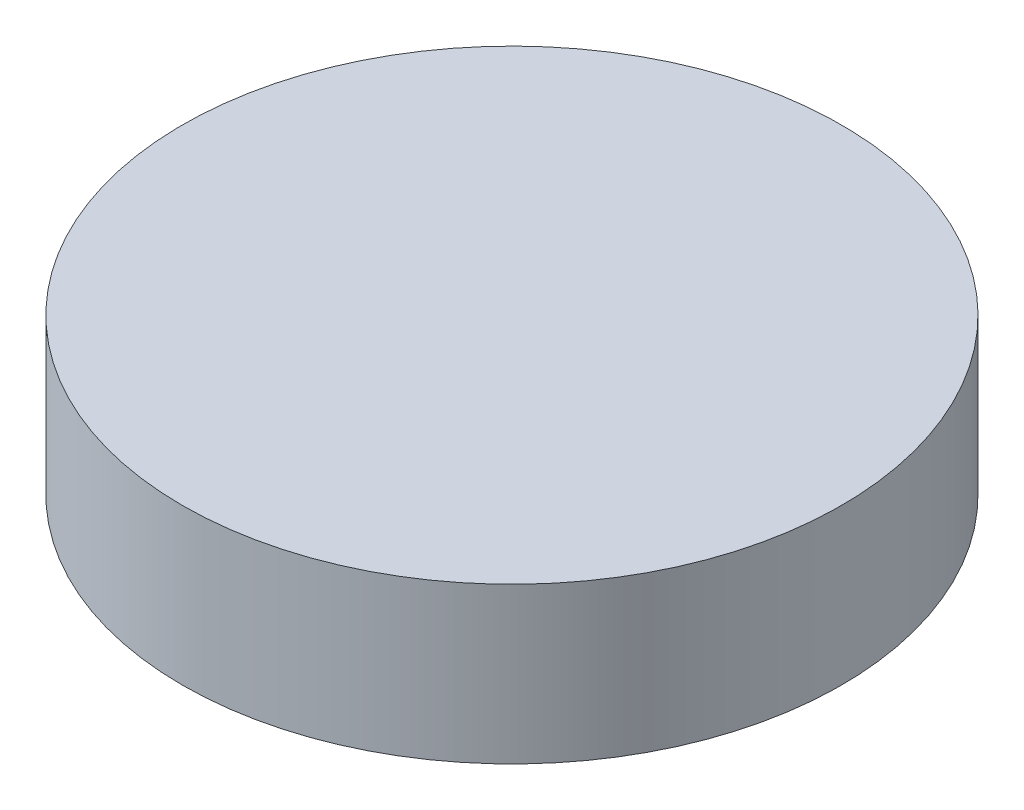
from build123d import *

# Parameters (mm, degrees)
SKETCH1_R           = 45
BOSS_EXTRUDE1_DEPTH = 21.25
SKETCH2_R           = 10
CUT_EXTRUDE1_DEPTH  = 20


with BuildPart() as part:
    # Sketch1 → Boss-Extrude1 (new body)
    with BuildSketch(Plane(origin=(0, 0, 0), x_dir=(1, 0, 0), z_dir=(0, 1, 0))):
        with Locations(Location((0, 0, 0), (0, 0, 270))):
            Circle(SKETCH1_R)
    extrude(amount=BOSS_EXTRUDE1_DEPTH)

    # Sketch2 → Cut-Extrude1 (cut)
    with BuildSketch(Plane.XZ):
        with Locations(Location((0, 0, 0), (0, 0, 270))):
            Circle(SKETCH2_R)
    extrude(amount=-CUT_EXTRUDE1_DEPTH, mode=Mode.SUBTRACT)


solid = part.part
